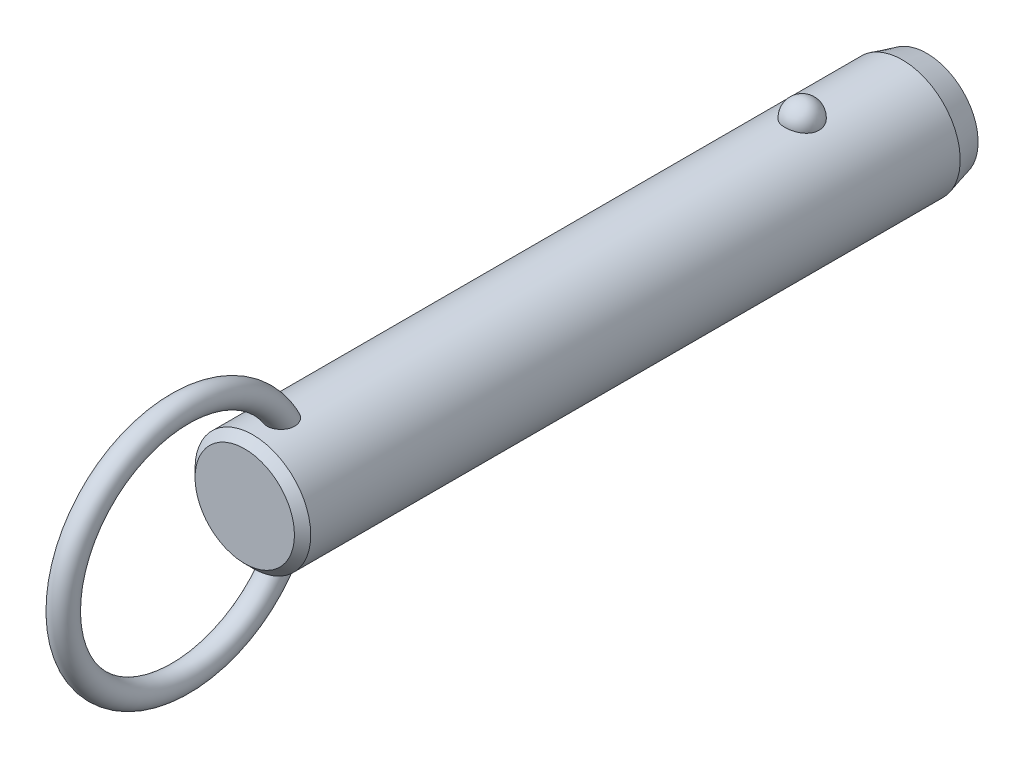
ISO-10303-21;
HEADER;
FILE_DESCRIPTION(('STEP AP214'),'2;1');
FILE_NAME('part.step','',(''),(''),'','','');
FILE_SCHEMA(('AUTOMOTIVE_DESIGN { 1 0 10303 214 1 1 1 1 }'));
ENDSEC;
DATA;
#1=APPLICATION_CONTEXT('core data for automotive mechanical design processes');
#2=APPLICATION_PROTOCOL_DEFINITION('international standard','automotive_design',2000,#1);
#3=PRODUCT_CONTEXT('',#1,'mechanical');
#4=PRODUCT('Part','Part','',(#3));
#5=PRODUCT_RELATED_PRODUCT_CATEGORY('part','',(#4));
#6=PRODUCT_DEFINITION_FORMATION('','',#4);
#7=PRODUCT_DEFINITION_CONTEXT('part definition',#1,'design');
#8=PRODUCT_DEFINITION('design','',#6,#7);
#9=PRODUCT_DEFINITION_SHAPE('','',#8);
#10=(LENGTH_UNIT() NAMED_UNIT(*) SI_UNIT(.MILLI.,.METRE.));
#11=(NAMED_UNIT(*) PLANE_ANGLE_UNIT() SI_UNIT($,.RADIAN.));
#12=(NAMED_UNIT(*) SI_UNIT($,.STERADIAN.) SOLID_ANGLE_UNIT());
#13=UNCERTAINTY_MEASURE_WITH_UNIT(LENGTH_MEASURE(1.E-05),#10,'distance_accuracy_value','');
#14=(GEOMETRIC_REPRESENTATION_CONTEXT(3) GLOBAL_UNCERTAINTY_ASSIGNED_CONTEXT((#13)) GLOBAL_UNIT_ASSIGNED_CONTEXT((#10,
#11,#12)) REPRESENTATION_CONTEXT('',''));
#15=CARTESIAN_POINT('',(0.,0.,0.));
#16=DIRECTION('',(0.,0.,1.));
#17=DIRECTION('',(1.,0.,0.));
#18=AXIS2_PLACEMENT_3D('',#15,#16,#17);
#19=CARTESIAN_POINT('',(0.,0.,58.4));
#20=DIRECTION('',(0.,0.,-1.));
#21=DIRECTION('',(-1.,0.,0.));
#22=AXIS2_PLACEMENT_3D('',#19,#20,#21);
#23=CYLINDRICAL_SURFACE('',#22,7.1);
#24=CARTESIAN_POINT('',(2.0769088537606,6.78943661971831,-2.1));
#25=CARTESIAN_POINT('',(2.07690739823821,6.78943796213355,-1.98268154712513));
#26=CARTESIAN_POINT('',(2.06738130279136,6.79237331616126,-1.86534506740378));
#27=CARTESIAN_POINT('',(2.0295040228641,6.8037853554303,-1.63400788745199));
#28=CARTESIAN_POINT('',(2.00114757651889,6.81226358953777,-1.52000812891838));
#29=CARTESIAN_POINT('',(1.92632025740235,6.83379798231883,-1.29863433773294));
#30=CARTESIAN_POINT('',(1.87985726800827,6.84685214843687,-1.19125744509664));
#31=CARTESIAN_POINT('',(1.76995205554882,6.87608091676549,-0.98604657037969));
#32=CARTESIAN_POINT('',(1.70650980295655,6.8922555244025,-0.88821260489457));
#33=CARTESIAN_POINT('',(1.5638119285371,6.92602930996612,-0.704242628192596));
#34=CARTESIAN_POINT('',(1.4844714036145,6.94363582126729,-0.618173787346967));
#35=CARTESIAN_POINT('',(1.31221746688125,6.97823658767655,-0.460740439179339));
#36=CARTESIAN_POINT('',(1.21930409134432,6.99523084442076,-0.389375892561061));
#37=CARTESIAN_POINT('',(1.02268781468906,7.02666176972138,-0.263547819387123));
#38=CARTESIAN_POINT('',(0.91902009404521,7.04110638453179,-0.209031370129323));
#39=CARTESIAN_POINT('',(0.703548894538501,7.06588726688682,-0.118163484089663));
#40=CARTESIAN_POINT('',(0.591746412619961,7.07622403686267,-0.0818098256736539));
#41=CARTESIAN_POINT('',(0.365557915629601,7.09147068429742,-0.0288711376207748));
#42=CARTESIAN_POINT('',(0.251267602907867,7.09648447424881,-0.0119070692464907));
#43=CARTESIAN_POINT('',(0.0213499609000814,7.10089837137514,0.00304925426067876));
#44=CARTESIAN_POINT('',(-0.0942772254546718,7.10029907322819,0.00104351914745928));
#45=CARTESIAN_POINT('',(-0.321651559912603,7.09360829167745,-0.0216931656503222));
#46=CARTESIAN_POINT('',(-0.433431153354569,7.08760388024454,-0.0421272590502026));
#47=CARTESIAN_POINT('',(-0.651862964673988,7.07086131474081,-0.100729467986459));
#48=CARTESIAN_POINT('',(-0.758515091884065,7.06012307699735,-0.138897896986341));
#49=CARTESIAN_POINT('',(-0.964449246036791,7.03496097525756,-0.232213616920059));
#50=CARTESIAN_POINT('',(-1.06368095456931,7.02051445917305,-0.287465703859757));
#51=CARTESIAN_POINT('',(-1.25145353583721,6.98948740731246,-0.413383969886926));
#52=CARTESIAN_POINT('',(-1.33999321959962,6.97290663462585,-0.48405186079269));
#53=CARTESIAN_POINT('',(-1.50591604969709,6.93898770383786,-0.640594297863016));
#54=CARTESIAN_POINT('',(-1.58302488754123,6.92164094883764,-0.726757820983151));
#55=CARTESIAN_POINT('',(-1.72189320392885,6.8884103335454,-0.91092752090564));
#56=CARTESIAN_POINT('',(-1.78365144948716,6.87252659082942,-1.008934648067));
#57=CARTESIAN_POINT('',(-1.89101272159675,6.84377189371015,-1.21549497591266));
#58=CARTESIAN_POINT('',(-1.93639553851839,6.83094274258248,-1.32416860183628));
#59=CARTESIAN_POINT('',(-2.00874275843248,6.81002070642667,-1.54791500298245));
#60=CARTESIAN_POINT('',(-2.03570774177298,6.80192767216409,-1.66298757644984));
#61=CARTESIAN_POINT('',(-2.07047276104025,6.7914266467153,-1.89571453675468));
#62=CARTESIAN_POINT('',(-2.07835878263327,6.78899315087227,-2.01335491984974));
#63=CARTESIAN_POINT('',(-2.07502083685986,6.79001409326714,-2.24833570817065));
#64=CARTESIAN_POINT('',(-2.06379746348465,6.7934683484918,-2.36567612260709));
#65=CARTESIAN_POINT('',(-2.02263913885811,6.80583442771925,-2.59603194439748));
#66=CARTESIAN_POINT('',(-1.99281127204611,6.81471501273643,-2.70906820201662));
#67=CARTESIAN_POINT('',(-1.91526639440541,6.83691232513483,-2.92836575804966));
#68=CARTESIAN_POINT('',(-1.8675486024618,6.85022924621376,-3.03462676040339));
#69=CARTESIAN_POINT('',(-1.75504492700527,6.87991336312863,-3.23806487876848));
#70=CARTESIAN_POINT('',(-1.69015924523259,6.89629822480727,-3.33518422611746));
#71=CARTESIAN_POINT('',(-1.54505404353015,6.93024852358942,-3.51697105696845));
#72=CARTESIAN_POINT('',(-1.46483385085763,6.94781401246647,-3.60163799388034));
#73=CARTESIAN_POINT('',(-1.29071406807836,6.98225977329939,-3.75654119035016));
#74=CARTESIAN_POINT('',(-1.19675650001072,6.99913673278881,-3.82671308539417));
#75=CARTESIAN_POINT('',(-0.997940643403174,7.03023618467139,-3.9501837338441));
#76=CARTESIAN_POINT('',(-0.89308318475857,7.04445887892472,-4.00348377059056));
#77=CARTESIAN_POINT('',(-0.676902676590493,7.06848365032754,-4.09107242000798));
#78=CARTESIAN_POINT('',(-0.565686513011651,7.0783430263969,-4.12560889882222));
#79=CARTESIAN_POINT('',(-0.338739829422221,7.09282534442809,-4.17575450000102));
#80=CARTESIAN_POINT('',(-0.223009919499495,7.09744899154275,-4.19136617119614));
#81=CARTESIAN_POINT('',(0.00707628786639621,7.10090930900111,-4.20307965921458));
#82=CARTESIAN_POINT('',(0.121410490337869,7.09986531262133,-4.19958377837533));
#83=CARTESIAN_POINT('',(0.347815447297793,7.092380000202,-4.17411564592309));
#84=CARTESIAN_POINT('',(0.459886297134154,7.08593891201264,-4.15214417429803));
#85=CARTESIAN_POINT('',(0.678084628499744,7.06838983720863,-4.09049562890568));
#86=CARTESIAN_POINT('',(0.784237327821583,7.05730369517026,-4.05090137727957));
#87=CARTESIAN_POINT('',(0.988305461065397,7.03163139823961,-3.95511447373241));
#88=CARTESIAN_POINT('',(1.08622031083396,7.01704499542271,-3.89892064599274));
#89=CARTESIAN_POINT('',(1.27284490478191,6.98562668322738,-3.77035541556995));
#90=CARTESIAN_POINT('',(1.36137372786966,6.96876135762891,-3.69772964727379));
#91=CARTESIAN_POINT('',(1.52509486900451,6.93477412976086,-3.53878279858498));
#92=CARTESIAN_POINT('',(1.60028496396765,6.91765218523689,-3.45245943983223));
#93=CARTESIAN_POINT('',(1.73681688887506,6.88465753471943,-3.26658774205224));
#94=CARTESIAN_POINT('',(1.79785966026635,6.86881574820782,-3.16681408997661));
#95=CARTESIAN_POINT('',(1.90265327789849,6.84053157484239,-2.95814408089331));
#96=CARTESIAN_POINT('',(1.94640861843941,6.82808830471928,-2.84925010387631));
#97=CARTESIAN_POINT('',(2.01274378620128,6.80881460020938,-2.63454318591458));
#98=CARTESIAN_POINT('',(2.03676193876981,6.80160856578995,-2.52920574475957));
#99=CARTESIAN_POINT('',(2.06884490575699,6.79191902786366,-2.3159172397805));
#100=CARTESIAN_POINT('',(2.07691019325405,6.78943538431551,-2.20796625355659));
#101=CARTESIAN_POINT('',(2.0769088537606,6.78943661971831,-2.1));
#102=B_SPLINE_CURVE_WITH_KNOTS('',3,(#24,#25,#26,#27,#28,#29,#30,#31,#32,#33,#34,#35,#36,#37,
#38,#39,#40,#41,#42,#43,#44,#45,#46,#47,#48,#49,#50,#51,#52,#53,#54,#55,#56,#57,#58,#59,#60,#61,
#62,#63,#64,#65,#66,#67,#68,#69,#70,#71,#72,#73,#74,#75,#76,#77,#78,#79,#80,#81,#82,#83,#84,#85,
#86,#87,#88,#89,#90,#91,#92,#93,#94,#95,#96,#97,#98,#99,#100,#101),.UNSPECIFIED.,.T.,.F.,(4,2,2,
2,2,2,2,2,2,2,2,2,2,2,2,2,2,2,2,2,2,2,2,2,2,2,2,2,2,2,2,2,2,2,2,2,2,2,4),(0.,0.351568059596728,
0.703234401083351,1.05474780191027,1.40626181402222,1.75970563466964,2.11314851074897,
2.4654696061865,2.81774759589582,3.16301449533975,3.50824481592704,3.84801136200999,
4.18778391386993,4.52968352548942,4.87162112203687,5.22076181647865,5.56993054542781,
5.92363364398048,6.27732559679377,6.62942052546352,6.98150450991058,7.33158042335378,
7.68167162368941,8.03384443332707,8.38603269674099,8.73975272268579,9.09344583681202,
9.44234545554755,9.79119807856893,10.1327344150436,10.4742563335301,10.8141898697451,
11.1541474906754,11.4997793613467,11.8454687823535,12.1979079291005,12.5502553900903,
12.8738073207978,13.1973496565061),.UNSPECIFIED.);
#103=CARTESIAN_POINT('',(2.0769088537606,6.78943661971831,-2.1));
#104=VERTEX_POINT('',#103);
#105=EDGE_CURVE('E41',#104,#104,#102,.T.);
#106=ORIENTED_EDGE('',*,*,#105,.T.);
#107=EDGE_LOOP('',(#106));
#108=FACE_BOUND('',#107,.T.);
#109=CARTESIAN_POINT('',(0.,0.,65.32));
#110=DIRECTION('',(0.,0.,1.));
#111=DIRECTION('',(1.,0.,0.));
#112=AXIS2_PLACEMENT_3D('',#109,#110,#111);
#113=CIRCLE('',#112,7.1);
#114=CARTESIAN_POINT('',(7.1,0.,65.32));
#115=VERTEX_POINT('',#114);
#116=EDGE_CURVE('E10',#115,#115,#113,.F.);
#117=ORIENTED_EDGE('',*,*,#116,.T.);
#118=EDGE_LOOP('',(#117));
#119=FACE_BOUND('',#118,.T.);
#120=CARTESIAN_POINT('',(-0.429539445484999,-7.08699541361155,60.1429212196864));
#121=CARTESIAN_POINT('',(-0.50833166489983,-7.08221999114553,60.1668764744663));
#122=CARTESIAN_POINT('',(-0.585039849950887,-7.07624016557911,60.1974570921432));
#123=CARTESIAN_POINT('',(-0.732082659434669,-7.06254296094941,60.2710242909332));
#124=CARTESIAN_POINT('',(-0.802417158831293,-7.05482554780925,60.3140111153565));
#125=CARTESIAN_POINT('',(-0.934722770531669,-7.03851844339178,60.4111135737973));
#126=CARTESIAN_POINT('',(-0.996700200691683,-7.02992941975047,60.4652207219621));
#127=CARTESIAN_POINT('',(-1.11079942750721,-7.01280697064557,60.5829676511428));
#128=CARTESIAN_POINT('',(-1.16292136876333,-7.00427354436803,60.6466072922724));
#129=CARTESIAN_POINT('',(-1.25705660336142,-6.98799959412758,60.7826870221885));
#130=CARTESIAN_POINT('',(-1.29888032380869,-6.98027525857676,60.8552598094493));
#131=CARTESIAN_POINT('',(-1.37069920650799,-6.96652886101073,61.0061686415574));
#132=CARTESIAN_POINT('',(-1.40069157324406,-6.96050720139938,61.0845060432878));
#133=CARTESIAN_POINT('',(-1.45043507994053,-6.95031881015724,61.2501903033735));
#134=CARTESIAN_POINT('',(-1.46937115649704,-6.94630231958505,61.3377897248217));
#135=CARTESIAN_POINT('',(-1.49424917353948,-6.94099239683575,61.5148714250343));
#136=CARTESIAN_POINT('',(-1.50018601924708,-6.93970003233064,61.6043544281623));
#137=CARTESIAN_POINT('',(-1.49978214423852,-6.93978815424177,61.7940607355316));
#138=CARTESIAN_POINT('',(-1.49187639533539,-6.94150934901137,61.894279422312));
#139=CARTESIAN_POINT('',(-1.46177925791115,-6.94790814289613,62.0924798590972));
#140=CARTESIAN_POINT('',(-1.43957541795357,-6.95258831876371,62.190459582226));
#141=CARTESIAN_POINT('',(-1.37783293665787,-6.96510647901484,62.3953629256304));
#142=CARTESIAN_POINT('',(-1.33634073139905,-6.97328848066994,62.5016801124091));
#143=CARTESIAN_POINT('',(-1.23686994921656,-6.99161706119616,62.7061777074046));
#144=CARTESIAN_POINT('',(-1.17889192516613,-7.00176357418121,62.8043583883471));
#145=CARTESIAN_POINT('',(-1.0587512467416,-7.02082898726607,62.9723743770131));
#146=CARTESIAN_POINT('',(-0.999247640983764,-7.02963746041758,63.0441230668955));
#147=CARTESIAN_POINT('',(-0.869494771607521,-7.04686074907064,63.1771959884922));
#148=CARTESIAN_POINT('',(-0.799263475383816,-7.05527619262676,63.2385372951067));
#149=CARTESIAN_POINT('',(-0.665408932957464,-7.06899457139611,63.3351316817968));
#150=CARTESIAN_POINT('',(-0.603817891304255,-7.07457275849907,63.3731512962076));
#151=CARTESIAN_POINT('',(-0.475172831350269,-7.08437420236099,63.4387581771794));
#152=CARTESIAN_POINT('',(-0.40812301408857,-7.08859848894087,63.4663533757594));
#153=CARTESIAN_POINT('',(-0.269431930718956,-7.09522749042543,63.5092569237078));
#154=CARTESIAN_POINT('',(-0.197757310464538,-7.09761688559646,63.5244618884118));
#155=CARTESIAN_POINT('',(-0.0527849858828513,-7.10017268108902,63.5407168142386));
#156=CARTESIAN_POINT('',(0.0205115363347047,-7.10034065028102,63.5417767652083));
#157=CARTESIAN_POINT('',(0.156426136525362,-7.09855986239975,63.5304619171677));
#158=CARTESIAN_POINT('',(0.219199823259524,-7.09688191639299,63.5198060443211));
#159=CARTESIAN_POINT('',(0.342134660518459,-7.09201880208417,63.4885379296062));
#160=CARTESIAN_POINT('',(0.402295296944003,-7.08883333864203,63.4679237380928));
#161=CARTESIAN_POINT('',(0.520687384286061,-7.08113868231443,63.4172125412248));
#162=CARTESIAN_POINT('',(0.578791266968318,-7.07658958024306,63.3868272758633));
#163=CARTESIAN_POINT('',(0.690173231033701,-7.06659708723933,63.3183678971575));
#164=CARTESIAN_POINT('',(0.743447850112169,-7.061153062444,63.2802883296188));
#165=CARTESIAN_POINT('',(0.870947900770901,-7.04680292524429,63.1765929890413));
#166=CARTESIAN_POINT('',(0.941828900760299,-7.0375580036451,63.1068972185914));
#167=CARTESIAN_POINT('',(1.07136606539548,-7.01900793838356,62.9569450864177));
#168=CARTESIAN_POINT('',(1.13000013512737,-7.00970271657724,62.8766700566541));
#169=CARTESIAN_POINT('',(1.23579584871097,-6.99183327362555,62.7068997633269));
#170=CARTESIAN_POINT('',(1.28274271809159,-6.98328455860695,62.6172696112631));
#171=CARTESIAN_POINT('',(1.36351442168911,-6.96796352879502,62.4321763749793));
#172=CARTESIAN_POINT('',(1.39733971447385,-6.96119115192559,62.3367134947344));
#173=CARTESIAN_POINT('',(1.45579181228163,-6.94922464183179,62.1253092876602));
#174=CARTESIAN_POINT('',(1.47790145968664,-6.94449000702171,62.008631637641));
#175=CARTESIAN_POINT('',(1.50168752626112,-6.93938731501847,61.7730153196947));
#176=CARTESIAN_POINT('',(1.50336085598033,-6.93901991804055,61.6540763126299));
#177=CARTESIAN_POINT('',(1.48486516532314,-6.9430010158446,61.4236079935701));
#178=CARTESIAN_POINT('',(1.46573441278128,-6.9471253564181,61.3119958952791));
#179=CARTESIAN_POINT('',(1.40606892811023,-6.95944667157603,61.0948868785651));
#180=CARTESIAN_POINT('',(1.3655644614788,-6.96763788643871,60.9893815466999));
#181=CARTESIAN_POINT('',(1.27082700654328,-6.98548038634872,60.8042879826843));
#182=CARTESIAN_POINT('',(1.21949810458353,-6.99473841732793,60.7231719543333));
#183=CARTESIAN_POINT('',(1.10242050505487,-7.01414069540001,60.5722278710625));
#184=CARTESIAN_POINT('',(1.03668119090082,-7.02428436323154,60.5023925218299));
#185=CARTESIAN_POINT('',(0.900559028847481,-7.04295285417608,60.3835735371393));
#186=CARTESIAN_POINT('',(0.831428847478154,-7.05153466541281,60.3331573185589));
#187=CARTESIAN_POINT('',(0.685291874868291,-7.06723150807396,60.2451429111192));
#188=CARTESIAN_POINT('',(0.608287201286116,-7.0743469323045,60.2075412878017));
#189=CARTESIAN_POINT('',(0.45187890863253,-7.08602232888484,60.1474915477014));
#190=CARTESIAN_POINT('',(0.372686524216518,-7.09067127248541,60.1245088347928));
#191=CARTESIAN_POINT('',(0.211477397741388,-7.09730788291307,60.0920357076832));
#192=CARTESIAN_POINT('',(0.129460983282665,-7.09929585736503,60.0825437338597));
#193=CARTESIAN_POINT('',(-0.0332905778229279,-7.10037858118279,60.0773517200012));
#194=CARTESIAN_POINT('',(-0.114016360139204,-7.09953334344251,60.0813656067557));
#195=CARTESIAN_POINT('',(-0.273670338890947,-7.09517338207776,60.1024540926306));
#196=CARTESIAN_POINT('',(-0.352598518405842,-7.09165863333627,60.1195288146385));
#197=CARTESIAN_POINT('',(-0.429539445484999,-7.08699541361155,60.1429212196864));
#198=B_SPLINE_CURVE_WITH_KNOTS('',3,(#120,#121,#122,#123,#124,#125,#126,#127,#128,#129,#130,
#131,#132,#133,#134,#135,#136,#137,#138,#139,#140,#141,#142,#143,#144,#145,#146,#147,#148,#149,
#150,#151,#152,#153,#154,#155,#156,#157,#158,#159,#160,#161,#162,#163,#164,#165,#166,#167,#168,
#169,#170,#171,#172,#173,#174,#175,#176,#177,#178,#179,#180,#181,#182,#183,#184,#185,#186,#187,
#188,#189,#190,#191,#192,#193,#194,#195,#196,#197),.UNSPECIFIED.,.T.,.F.,(4,2,2,2,2,2,2,2,2,2,2,
2,2,2,2,2,2,2,2,2,2,2,2,2,2,2,2,2,2,2,2,2,2,2,2,2,2,2,4),(0.,0.247183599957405,
0.494372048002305,0.741372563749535,0.988369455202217,1.23962059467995,1.49093106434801,
1.75897818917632,2.02713035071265,2.32758265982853,2.62829697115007,2.97008736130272,
3.31186629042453,3.5917531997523,3.87117637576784,4.08813841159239,4.30493502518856,
4.52352259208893,4.74195577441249,4.93215328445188,5.12238804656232,5.31884850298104,
5.51544871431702,5.81332317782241,6.11173048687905,6.41527266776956,6.71880423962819,
7.07358156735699,7.42841252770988,7.7663148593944,8.10373999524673,8.39142246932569,
8.67891817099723,8.93560332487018,9.19221962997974,9.43881106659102,9.68537399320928,
9.92674752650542,10.1681233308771),.UNSPECIFIED.);
#199=CARTESIAN_POINT('',(-0.429539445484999,-7.08699541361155,60.1429212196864));
#200=VERTEX_POINT('',#199);
#201=EDGE_CURVE('E59',#200,#200,#198,.T.);
#202=ORIENTED_EDGE('',*,*,#201,.T.);
#203=EDGE_LOOP('',(#202));
#204=FACE_BOUND('',#203,.T.);
#205=CARTESIAN_POINT('',(-0.429539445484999,7.08699541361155,60.1429212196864));
#206=CARTESIAN_POINT('',(-0.351665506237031,7.09171429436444,60.1192469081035));
#207=CARTESIAN_POINT('',(-0.271733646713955,7.09525896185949,60.1020369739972));
#208=CARTESIAN_POINT('',(-0.110026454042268,7.09960839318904,60.0810059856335));
#209=CARTESIAN_POINT('',(-0.0282502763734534,7.10041187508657,60.077191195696));
#210=CARTESIAN_POINT('',(0.134782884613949,7.09918849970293,60.083059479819));
#211=CARTESIAN_POINT('',(0.216039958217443,7.09716214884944,60.0927401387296));
#212=CARTESIAN_POINT('',(0.375730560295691,7.09050177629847,60.1253471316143));
#213=CARTESIAN_POINT('',(0.454164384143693,7.08586802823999,60.1482720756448));
#214=CARTESIAN_POINT('',(0.606025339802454,7.07449911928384,60.206771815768));
#215=CARTESIAN_POINT('',(0.679451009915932,7.06776334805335,60.2423502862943));
#216=CARTESIAN_POINT('',(0.819234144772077,7.05292866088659,60.3251753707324));
#217=CARTESIAN_POINT('',(0.88559181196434,7.04482978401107,60.3724216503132));
#218=CARTESIAN_POINT('',(1.00993211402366,7.02808709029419,60.4775902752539));
#219=CARTESIAN_POINT('',(1.06785399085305,7.01943990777,60.535583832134));
#220=CARTESIAN_POINT('',(1.17342527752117,7.00256662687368,60.6603013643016));
#221=CARTESIAN_POINT('',(1.22107408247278,6.99434055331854,60.7270258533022));
#222=CARTESIAN_POINT('',(1.30652927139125,6.97889183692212,60.8693622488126));
#223=CARTESIAN_POINT('',(1.34399711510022,6.97170674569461,60.9451808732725));
#224=CARTESIAN_POINT('',(1.40682616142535,6.95930080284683,61.1018100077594));
#225=CARTESIAN_POINT('',(1.43218374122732,6.95408053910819,61.1826220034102));
#226=CARTESIAN_POINT('',(1.47246409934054,6.94566853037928,61.3535314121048));
#227=CARTESIAN_POINT('',(1.48642590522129,6.9426653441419,61.4438630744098));
#228=CARTESIAN_POINT('',(1.5011410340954,6.93949744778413,61.625619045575));
#229=CARTESIAN_POINT('',(1.50188917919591,6.93933385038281,61.7170437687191));
#230=CARTESIAN_POINT('',(1.49030464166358,6.94183245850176,61.9108438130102));
#231=CARTESIAN_POINT('',(1.47627413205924,6.94486147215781,62.013112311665));
#232=CARTESIAN_POINT('',(1.43356351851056,6.95380194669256,62.2144719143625));
#233=CARTESIAN_POINT('',(1.4048676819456,6.95971650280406,62.3135594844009));
#234=CARTESIAN_POINT('',(1.32908750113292,6.97461208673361,62.5189087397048));
#235=CARTESIAN_POINT('',(1.28011435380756,6.98388945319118,62.6244566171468));
#236=CARTESIAN_POINT('',(1.16520357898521,7.00397743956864,62.8257604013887));
#237=CARTESIAN_POINT('',(1.09927694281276,7.01478706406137,62.9215225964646));
#238=CARTESIAN_POINT('',(0.969361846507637,7.03373936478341,63.0767565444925));
#239=CARTESIAN_POINT('',(0.909042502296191,7.04187023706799,63.1393032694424));
#240=CARTESIAN_POINT('',(0.779178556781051,7.05741732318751,63.2540535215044));
#241=CARTESIAN_POINT('',(0.70964977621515,7.06483472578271,63.3062744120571));
#242=CARTESIAN_POINT('',(0.576854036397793,7.0767751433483,63.3881138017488));
#243=CARTESIAN_POINT('',(0.51511813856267,7.08158033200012,63.4201641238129));
#244=CARTESIAN_POINT('',(0.387127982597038,7.08972701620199,63.4737656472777));
#245=CARTESIAN_POINT('',(0.320877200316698,7.09306962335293,63.4953248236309));
#246=CARTESIAN_POINT('',(0.185041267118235,7.09791507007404,63.5264005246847));
#247=CARTESIAN_POINT('',(0.115437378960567,7.09940591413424,63.5358385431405));
#248=CARTESIAN_POINT('',(-0.0243157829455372,7.10030171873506,63.5415226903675));
#249=CARTESIAN_POINT('',(-0.0944648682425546,7.0997073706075,63.5377731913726));
#250=CARTESIAN_POINT('',(-0.225713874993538,7.09668414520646,63.5185081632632));
#251=CARTESIAN_POINT('',(-0.287006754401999,7.09444865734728,63.5042323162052));
#252=CARTESIAN_POINT('',(-0.406555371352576,7.08860360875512,63.4663685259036));
#253=CARTESIAN_POINT('',(-0.464809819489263,7.08499346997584,63.4427766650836));
#254=CARTESIAN_POINT('',(-0.594955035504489,7.07541654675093,63.3789232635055));
#255=CARTESIAN_POINT('',(-0.665389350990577,7.06906574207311,63.335753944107));
#256=CARTESIAN_POINT('',(-0.798242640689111,7.05530261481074,63.238587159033));
#257=CARTESIAN_POINT('',(-0.860645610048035,7.0478882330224,63.1845686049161));
#258=CARTESIAN_POINT('',(-0.994249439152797,7.03045217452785,63.0509965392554));
#259=CARTESIAN_POINT('',(-1.06260129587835,7.02030745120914,62.9686143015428));
#260=CARTESIAN_POINT('',(-1.18502045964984,7.00068382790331,62.793843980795));
#261=CARTESIAN_POINT('',(-1.23907684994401,6.99120544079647,62.701448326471));
#262=CARTESIAN_POINT('',(-1.33335589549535,6.97384343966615,62.5080085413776));
#263=CARTESIAN_POINT('',(-1.37336138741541,6.96598557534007,62.4068564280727));
#264=CARTESIAN_POINT('',(-1.43770677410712,6.9529905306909,62.1995046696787));
#265=CARTESIAN_POINT('',(-1.46204473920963,6.94785368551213,62.09330440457));
#266=CARTESIAN_POINT('',(-1.49537533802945,6.94076296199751,61.8682317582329));
#267=CARTESIAN_POINT('',(-1.50273564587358,6.93914842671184,61.7490975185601));
#268=CARTESIAN_POINT('',(-1.4954555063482,6.94072368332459,61.5114703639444));
#269=CARTESIAN_POINT('',(-1.48082914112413,6.94391040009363,61.3929770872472));
#270=CARTESIAN_POINT('',(-1.43076401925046,6.95438579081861,61.1734325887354));
#271=CARTESIAN_POINT('',(-1.39762227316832,6.96121852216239,61.0718413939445));
#272=CARTESIAN_POINT('',(-1.31211274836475,6.97783941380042,60.8773513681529));
#273=CARTESIAN_POINT('',(-1.25976607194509,6.98762432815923,60.7844431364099));
#274=CARTESIAN_POINT('',(-1.14583073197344,7.00713153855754,60.6241601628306));
#275=CARTESIAN_POINT('',(-1.08665947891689,7.01665982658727,60.5550351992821));
#276=CARTESIAN_POINT('',(-0.95660664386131,7.03556646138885,60.4288786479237));
#277=CARTESIAN_POINT('',(-0.885737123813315,7.04494495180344,60.3718347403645));
#278=CARTESIAN_POINT('',(-0.75155804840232,7.06035735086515,60.2831004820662));
#279=CARTESIAN_POINT('',(-0.690120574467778,7.0666695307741,60.2485932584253));
#280=CARTESIAN_POINT('',(-0.562815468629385,7.07794609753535,60.1887507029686));
#281=CARTESIAN_POINT('',(-0.496948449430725,7.08291067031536,60.1634141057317));
#282=CARTESIAN_POINT('',(-0.429539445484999,7.08699541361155,60.1429212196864));
#283=B_SPLINE_CURVE_WITH_KNOTS('',3,(#205,#206,#207,#208,#209,#210,#211,#212,#213,#214,#215,
#216,#217,#218,#219,#220,#221,#222,#223,#224,#225,#226,#227,#228,#229,#230,#231,#232,#233,#234,
#235,#236,#237,#238,#239,#240,#241,#242,#243,#244,#245,#246,#247,#248,#249,#250,#251,#252,#253,
#254,#255,#256,#257,#258,#259,#260,#261,#262,#263,#264,#265,#266,#267,#268,#269,#270,#271,#272,
#273,#274,#275,#276,#277,#278,#279,#280,#281,#282),.UNSPECIFIED.,.T.,.F.,(4,2,2,2,2,2,2,2,2,2,2,
2,2,2,2,2,2,2,2,2,2,2,2,2,2,2,2,2,2,2,2,2,2,2,2,2,2,2,4),(0.,0.244335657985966,
0.488785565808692,0.733191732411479,0.977572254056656,1.22202379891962,1.46646834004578,
1.71259457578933,1.9587352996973,2.21226768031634,2.46587585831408,2.7391381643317,
3.01250754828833,3.32109936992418,3.63002293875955,3.97863512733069,4.32702187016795,
4.58793945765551,4.84841449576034,5.05676704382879,5.26496096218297,5.47449661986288,
5.68396281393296,5.87205447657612,6.06022532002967,6.30743751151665,6.55513496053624,
6.87602468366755,7.19715875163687,7.52305774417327,7.84899686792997,8.20516155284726,
8.56109821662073,8.88040084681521,9.19935367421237,9.4723628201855,9.74509220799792,
9.95662250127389,10.1681235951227),.UNSPECIFIED.);
#284=CARTESIAN_POINT('',(-0.429539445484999,7.08699541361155,60.1429212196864));
#285=VERTEX_POINT('',#284);
#286=EDGE_CURVE('E67',#285,#285,#283,.T.);
#287=ORIENTED_EDGE('',*,*,#286,.T.);
#288=EDGE_LOOP('',(#287));
#289=FACE_BOUND('',#288,.T.);
#290=CARTESIAN_POINT('',(0.,0.,-14.3999999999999));
#291=DIRECTION('',(0.,0.,-1.));
#292=DIRECTION('',(-1.,0.,0.));
#293=AXIS2_PLACEMENT_3D('',#290,#291,#292);
#294=CIRCLE('',#293,7.1);
#295=CARTESIAN_POINT('',(-7.1,0.,-14.3999999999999));
#296=VERTEX_POINT('',#295);
#297=EDGE_CURVE('E56',#296,#296,#294,.F.);
#298=ORIENTED_EDGE('',*,*,#297,.T.);
#299=EDGE_LOOP('',(#298));
#300=FACE_BOUND('',#299,.T.);
#301=ADVANCED_FACE('F37',(#108,#119,#204,#289,#300),#23,.T.);
#302=CARTESIAN_POINT('',(0.,0.,-17.4));
#303=DIRECTION('',(0.,0.,-1.));
#304=DIRECTION('',(-1.,0.,0.));
#305=AXIS2_PLACEMENT_3D('',#302,#303,#304);
#306=PLANE('',#305);
#307=CARTESIAN_POINT('',(0.,0.,-17.4));
#308=DIRECTION('',(0.,0.,-1.));
#309=DIRECTION('',(-1.,0.,0.));
#310=AXIS2_PLACEMENT_3D('',#307,#308,#309);
#311=CIRCLE('',#310,6.29615242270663);
#312=CARTESIAN_POINT('',(-6.29615242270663,0.,-17.4));
#313=VERTEX_POINT('',#312);
#314=EDGE_CURVE('E66',#313,#313,#311,.T.);
#315=ORIENTED_EDGE('',*,*,#314,.T.);
#316=EDGE_LOOP('',(#315));
#317=FACE_BOUND('',#316,.T.);
#318=ADVANCED_FACE('F85',(#317),#306,.T.);
#319=CARTESIAN_POINT('',(0.,0.,-17.4));
#320=DIRECTION('',(0.,0.,1.));
#321=DIRECTION('',(1.,0.,0.));
#322=AXIS2_PLACEMENT_3D('',#319,#320,#321);
#323=CONICAL_SURFACE('',#322,6.29615242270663,0.261799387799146);
#324=ORIENTED_EDGE('',*,*,#297,.F.);
#325=EDGE_LOOP('',(#324));
#326=FACE_BOUND('',#325,.T.);
#327=ORIENTED_EDGE('',*,*,#314,.F.);
#328=EDGE_LOOP('',(#327));
#329=FACE_BOUND('',#328,.T.);
#330=ADVANCED_FACE('F83',(#326,#329),#323,.T.);
#331=CARTESIAN_POINT('',(0.,0.,66.32));
#332=DIRECTION('',(0.,0.,1.));
#333=DIRECTION('',(1.,0.,0.));
#334=AXIS2_PLACEMENT_3D('',#331,#332,#333);
#335=PLANE('',#334);
#336=CARTESIAN_POINT('',(0.,0.,66.32));
#337=DIRECTION('',(0.,0.,1.));
#338=DIRECTION('',(1.,0.,0.));
#339=AXIS2_PLACEMENT_3D('',#336,#337,#338);
#340=CIRCLE('',#339,6.10000000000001);
#341=CARTESIAN_POINT('',(6.10000000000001,0.,66.32));
#342=VERTEX_POINT('',#341);
#343=EDGE_CURVE('E50',#342,#342,#340,.T.);
#344=ORIENTED_EDGE('',*,*,#343,.T.);
#345=EDGE_LOOP('',(#344));
#346=FACE_BOUND('',#345,.T.);
#347=ADVANCED_FACE('F77',(#346),#335,.T.);
#348=CARTESIAN_POINT('',(0.,0.,74.25));
#349=DIRECTION('',(1.,0.,0.));
#350=DIRECTION('',(0.,0.,-1.));
#351=AXIS2_PLACEMENT_3D('',#348,#349,#350);
#352=TOROIDAL_SURFACE('',#351,14.35,1.5);
#353=ORIENTED_EDGE('',*,*,#286,.F.);
#354=EDGE_LOOP('',(#353));
#355=FACE_BOUND('',#354,.T.);
#356=ORIENTED_EDGE('',*,*,#201,.F.);
#357=EDGE_LOOP('',(#356));
#358=FACE_BOUND('',#357,.T.);
#359=ADVANCED_FACE('F73',(#355,#358),#352,.T.);
#360=CARTESIAN_POINT('',(0.,0.,66.32));
#361=DIRECTION('',(0.,0.,-1.));
#362=DIRECTION('',(-1.,0.,0.));
#363=AXIS2_PLACEMENT_3D('',#360,#361,#362);
#364=CONICAL_SURFACE('',#363,6.10000000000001,0.785398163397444);
#365=ORIENTED_EDGE('',*,*,#116,.F.);
#366=EDGE_LOOP('',(#365));
#367=FACE_BOUND('',#366,.T.);
#368=ORIENTED_EDGE('',*,*,#343,.F.);
#369=EDGE_LOOP('',(#368));
#370=FACE_BOUND('',#369,.T.);
#371=ADVANCED_FACE('F39',(#367,#370),#364,.T.);
#372=CARTESIAN_POINT('',(0.,7.1,-2.1));
#373=DIRECTION('',(0.,1.,0.));
#374=DIRECTION('',(0.,0.,1.));
#375=AXIS2_PLACEMENT_3D('',#372,#373,#374);
#376=SPHERICAL_SURFACE('',#375,2.10000000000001);
#377=ORIENTED_EDGE('',*,*,#105,.F.);
#378=EDGE_LOOP('',(#377));
#379=FACE_BOUND('',#378,.T.);
#380=ADVANCED_FACE('F79',(#379),#376,.T.);
#381=CLOSED_SHELL('',(#301,#318,#330,#347,#359,#371,#380));
#382=MANIFOLD_SOLID_BREP('B2',#381);
#383=ADVANCED_BREP_SHAPE_REPRESENTATION('',(#18,#382),#14);
#384=SHAPE_DEFINITION_REPRESENTATION(#9,#383);
ENDSEC;
END-ISO-10303-21;
